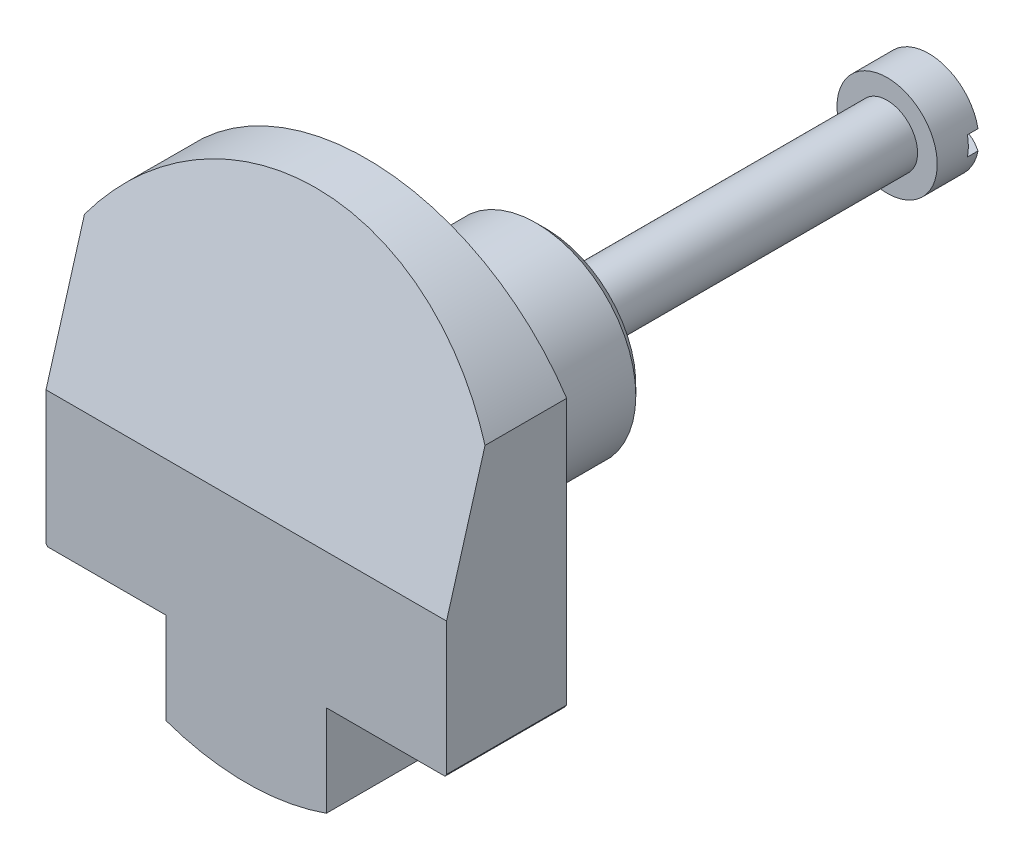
ISO-10303-21;
HEADER;
FILE_DESCRIPTION(('STEP AP214'),'2;1');
FILE_NAME('part.step','',(''),(''),'','','');
FILE_SCHEMA(('AUTOMOTIVE_DESIGN { 1 0 10303 214 1 1 1 1 }'));
ENDSEC;
DATA;
#1=APPLICATION_CONTEXT('core data for automotive mechanical design processes');
#2=APPLICATION_PROTOCOL_DEFINITION('international standard','automotive_design',2000,#1);
#3=PRODUCT_CONTEXT('',#1,'mechanical');
#4=PRODUCT('Part','Part','',(#3));
#5=PRODUCT_RELATED_PRODUCT_CATEGORY('part','',(#4));
#6=PRODUCT_DEFINITION_FORMATION('','',#4);
#7=PRODUCT_DEFINITION_CONTEXT('part definition',#1,'design');
#8=PRODUCT_DEFINITION('design','',#6,#7);
#9=PRODUCT_DEFINITION_SHAPE('','',#8);
#10=(LENGTH_UNIT() NAMED_UNIT(*) SI_UNIT(.MILLI.,.METRE.));
#11=(NAMED_UNIT(*) PLANE_ANGLE_UNIT() SI_UNIT($,.RADIAN.));
#12=(NAMED_UNIT(*) SI_UNIT($,.STERADIAN.) SOLID_ANGLE_UNIT());
#13=UNCERTAINTY_MEASURE_WITH_UNIT(LENGTH_MEASURE(1.E-05),#10,'distance_accuracy_value','');
#14=(GEOMETRIC_REPRESENTATION_CONTEXT(3) GLOBAL_UNCERTAINTY_ASSIGNED_CONTEXT((#13)) GLOBAL_UNIT_ASSIGNED_CONTEXT((#10,
#11,#12)) REPRESENTATION_CONTEXT('',''));
#15=CARTESIAN_POINT('',(0.,0.,0.));
#16=DIRECTION('',(0.,0.,1.));
#17=DIRECTION('',(1.,0.,0.));
#18=AXIS2_PLACEMENT_3D('',#15,#16,#17);
#19=CARTESIAN_POINT('',(0.,0.,-38.9909685));
#20=DIRECTION('',(0.,0.,-1.));
#21=DIRECTION('',(0.,1.,0.));
#22=AXIS2_PLACEMENT_3D('',#19,#20,#21);
#23=SPHERICAL_SURFACE('',#22,6.85603150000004);
#24=CARTESIAN_POINT('',(0.,0.,-44.577));
#25=DIRECTION('',(0.,0.,-1.));
#26=DIRECTION('',(-1.,0.,0.));
#27=AXIS2_PLACEMENT_3D('',#24,#25,#26);
#28=CIRCLE('',#27,3.9751);
#29=CARTESIAN_POINT('',(-3.90138129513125,0.762,-44.577));
#30=VERTEX_POINT('',#29);
#31=CARTESIAN_POINT('',(3.90138129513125,0.762,-44.577));
#32=VERTEX_POINT('',#31);
#33=EDGE_CURVE('E147',#30,#32,#28,.T.);
#34=ORIENTED_EDGE('',*,*,#33,.T.);
#35=CARTESIAN_POINT('',(0.,0.762,-38.9909685));
#36=DIRECTION('',(0.,-1.,0.));
#37=DIRECTION('',(1.,0.,0.));
#38=AXIS2_PLACEMENT_3D('',#35,#36,#37);
#39=CIRCLE('',#38,6.81355442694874);
#40=EDGE_CURVE('E136',#32,#30,#39,.F.);
#41=ORIENTED_EDGE('',*,*,#40,.T.);
#42=EDGE_LOOP('',(#34,#41));
#43=FACE_BOUND('',#42,.T.);
#44=ADVANCED_FACE('F14',(#43),#23,.T.);
#45=CARTESIAN_POINT('',(-3.9751,0.762,-43.7388));
#46=DIRECTION('',(0.,-1.,0.));
#47=DIRECTION('',(1.,0.,0.));
#48=AXIS2_PLACEMENT_3D('',#45,#46,#47);
#49=PLANE('',#48);
#50=DIRECTION('',(0.,0.,-1.));
#51=VECTOR('',#50,1.);
#52=CARTESIAN_POINT('',(-3.90138129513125,0.762,-71.247));
#53=LINE('',#52,#51);
#54=CARTESIAN_POINT('',(-3.90138129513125,0.762,-43.7388));
#55=VERTEX_POINT('',#54);
#56=EDGE_CURVE('E132',#55,#30,#53,.T.);
#57=ORIENTED_EDGE('',*,*,#56,.T.);
#58=ORIENTED_EDGE('',*,*,#40,.F.);
#59=DIRECTION('',(0.,0.,-1.));
#60=VECTOR('',#59,1.);
#61=CARTESIAN_POINT('',(3.90138129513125,0.762,-71.247));
#62=LINE('',#61,#60);
#63=CARTESIAN_POINT('',(3.90138129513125,0.762,-43.7388));
#64=VERTEX_POINT('',#63);
#65=EDGE_CURVE('E151',#32,#64,#62,.F.);
#66=ORIENTED_EDGE('',*,*,#65,.T.);
#67=DIRECTION('',(-1.,0.,0.));
#68=VECTOR('',#67,1.);
#69=CARTESIAN_POINT('',(-3.9751,0.762,-43.7388));
#70=LINE('',#69,#68);
#71=EDGE_CURVE('E139',#64,#55,#70,.T.);
#72=ORIENTED_EDGE('',*,*,#71,.T.);
#73=EDGE_LOOP('',(#57,#58,#66,#72));
#74=FACE_BOUND('',#73,.T.);
#75=ADVANCED_FACE('F134',(#74),#49,.T.);
#76=CARTESIAN_POINT('',(3.9751,-0.762,-43.7388));
#77=DIRECTION('',(0.,0.,1.));
#78=DIRECTION('',(1.,0.,0.));
#79=AXIS2_PLACEMENT_3D('',#76,#77,#78);
#80=PLANE('',#79);
#81=ORIENTED_EDGE('',*,*,#71,.F.);
#82=CARTESIAN_POINT('',(0.,0.,-43.7388));
#83=DIRECTION('',(0.,0.,1.));
#84=DIRECTION('',(1.,0.,0.));
#85=AXIS2_PLACEMENT_3D('',#82,#83,#84);
#86=CIRCLE('',#85,3.9751);
#87=CARTESIAN_POINT('',(3.90138129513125,-0.762,-43.7388));
#88=VERTEX_POINT('',#87);
#89=EDGE_CURVE('E152',#88,#64,#86,.T.);
#90=ORIENTED_EDGE('',*,*,#89,.F.);
#91=DIRECTION('',(1.,0.,0.));
#92=VECTOR('',#91,1.);
#93=CARTESIAN_POINT('',(3.9751,-0.762,-43.7388));
#94=LINE('',#93,#92);
#95=CARTESIAN_POINT('',(-3.90138129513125,-0.762,-43.7388));
#96=VERTEX_POINT('',#95);
#97=EDGE_CURVE('E244',#96,#88,#94,.T.);
#98=ORIENTED_EDGE('',*,*,#97,.F.);
#99=EDGE_CURVE('E143',#55,#96,#86,.T.);
#100=ORIENTED_EDGE('',*,*,#99,.F.);
#101=EDGE_LOOP('',(#81,#90,#98,#100));
#102=FACE_BOUND('',#101,.T.);
#103=ADVANCED_FACE('F282',(#102),#80,.F.);
#104=CARTESIAN_POINT('',(3.90138129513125,-0.762,-44.577));
#105=VERTEX_POINT('',#104);
#106=CARTESIAN_POINT('',(-3.90138129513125,-0.762,-44.577));
#107=VERTEX_POINT('',#106);
#108=EDGE_CURVE('E153',#105,#107,#28,.T.);
#109=ORIENTED_EDGE('',*,*,#108,.T.);
#110=CARTESIAN_POINT('',(0.,-0.762,-38.9909685));
#111=DIRECTION('',(0.,1.,0.));
#112=DIRECTION('',(-1.,0.,0.));
#113=AXIS2_PLACEMENT_3D('',#110,#111,#112);
#114=CIRCLE('',#113,6.81355442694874);
#115=EDGE_CURVE('E148',#107,#105,#114,.F.);
#116=ORIENTED_EDGE('',*,*,#115,.T.);
#117=EDGE_LOOP('',(#109,#116));
#118=FACE_BOUND('',#117,.T.);
#119=ADVANCED_FACE('F277',(#118),#23,.T.);
#120=CARTESIAN_POINT('',(3.9751,-0.762,-43.7388));
#121=DIRECTION('',(0.,1.,0.));
#122=DIRECTION('',(-1.,0.,0.));
#123=AXIS2_PLACEMENT_3D('',#120,#121,#122);
#124=PLANE('',#123);
#125=DIRECTION('',(0.,0.,-1.));
#126=VECTOR('',#125,1.);
#127=CARTESIAN_POINT('',(3.90138129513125,-0.762,-71.247));
#128=LINE('',#127,#126);
#129=EDGE_CURVE('E33',#88,#105,#128,.T.);
#130=ORIENTED_EDGE('',*,*,#129,.T.);
#131=ORIENTED_EDGE('',*,*,#115,.F.);
#132=DIRECTION('',(0.,0.,-1.));
#133=VECTOR('',#132,1.);
#134=CARTESIAN_POINT('',(-3.90138129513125,-0.762,-71.247));
#135=LINE('',#134,#133);
#136=EDGE_CURVE('E115',#107,#96,#135,.F.);
#137=ORIENTED_EDGE('',*,*,#136,.T.);
#138=ORIENTED_EDGE('',*,*,#97,.T.);
#139=EDGE_LOOP('',(#130,#131,#137,#138));
#140=FACE_BOUND('',#139,.T.);
#141=ADVANCED_FACE('F272',(#140),#124,.T.);
#142=CARTESIAN_POINT('',(0.,0.,-71.247));
#143=DIRECTION('',(0.,0.,-1.));
#144=DIRECTION('',(-1.,0.,0.));
#145=AXIS2_PLACEMENT_3D('',#142,#143,#144);
#146=CYLINDRICAL_SURFACE('',#145,3.9751);
#147=CARTESIAN_POINT('',(0.,0.,-41.275));
#148=DIRECTION('',(0.,0.,-1.));
#149=DIRECTION('',(-1.,0.,0.));
#150=AXIS2_PLACEMENT_3D('',#147,#148,#149);
#151=CIRCLE('',#150,3.9751);
#152=CARTESIAN_POINT('',(-3.9751,0.,-41.275));
#153=VERTEX_POINT('',#152);
#154=EDGE_CURVE('E157',#153,#153,#151,.T.);
#155=ORIENTED_EDGE('',*,*,#154,.T.);
#156=EDGE_LOOP('',(#155));
#157=FACE_BOUND('',#156,.T.);
#158=ORIENTED_EDGE('',*,*,#136,.F.);
#159=ORIENTED_EDGE('',*,*,#108,.F.);
#160=ORIENTED_EDGE('',*,*,#129,.F.);
#161=ORIENTED_EDGE('',*,*,#89,.T.);
#162=ORIENTED_EDGE('',*,*,#65,.F.);
#163=ORIENTED_EDGE('',*,*,#33,.F.);
#164=ORIENTED_EDGE('',*,*,#56,.F.);
#165=ORIENTED_EDGE('',*,*,#99,.T.);
#166=EDGE_LOOP('',(#158,#159,#160,#161,#162,#163,#164,#165));
#167=FACE_BOUND('',#166,.T.);
#168=ADVANCED_FACE('F150',(#157,#167),#146,.T.);
#169=CARTESIAN_POINT('',(0.,2.413,-41.275));
#170=DIRECTION('',(0.,0.,-1.));
#171=DIRECTION('',(-1.,0.,0.));
#172=AXIS2_PLACEMENT_3D('',#169,#170,#171);
#173=PLANE('',#172);
#174=ORIENTED_EDGE('',*,*,#154,.F.);
#175=EDGE_LOOP('',(#174));
#176=FACE_BOUND('',#175,.T.);
#177=CARTESIAN_POINT('',(0.,0.,-41.275));
#178=DIRECTION('',(0.,0.,-1.));
#179=DIRECTION('',(-1.,0.,0.));
#180=AXIS2_PLACEMENT_3D('',#177,#178,#179);
#181=CIRCLE('',#180,2.413);
#182=CARTESIAN_POINT('',(-2.413,0.,-41.275));
#183=VERTEX_POINT('',#182);
#184=EDGE_CURVE('E251',#183,#183,#181,.T.);
#185=ORIENTED_EDGE('',*,*,#184,.T.);
#186=EDGE_LOOP('',(#185));
#187=FACE_BOUND('',#186,.T.);
#188=ADVANCED_FACE('F259',(#176,#187),#173,.F.);
#189=CARTESIAN_POINT('',(0.,0.,-71.247));
#190=DIRECTION('',(0.,0.,-1.));
#191=DIRECTION('',(-1.,0.,0.));
#192=AXIS2_PLACEMENT_3D('',#189,#190,#191);
#193=CYLINDRICAL_SURFACE('',#192,2.413);
#194=CARTESIAN_POINT('',(0.,0.,-14.224));
#195=DIRECTION('',(0.,0.,-1.));
#196=DIRECTION('',(-1.,0.,0.));
#197=AXIS2_PLACEMENT_3D('',#194,#195,#196);
#198=CIRCLE('',#197,2.413);
#199=CARTESIAN_POINT('',(-2.413,0.,-14.224));
#200=VERTEX_POINT('',#199);
#201=EDGE_CURVE('E9',#200,#200,#198,.F.);
#202=ORIENTED_EDGE('',*,*,#201,.F.);
#203=EDGE_LOOP('',(#202));
#204=FACE_BOUND('',#203,.T.);
#205=ORIENTED_EDGE('',*,*,#184,.F.);
#206=EDGE_LOOP('',(#205));
#207=FACE_BOUND('',#206,.T.);
#208=ADVANCED_FACE('F261',(#204,#207),#193,.T.);
#209=CARTESIAN_POINT('',(0.,0.,-14.224));
#210=DIRECTION('',(0.,0.,-1.));
#211=DIRECTION('',(-1.,0.,0.));
#212=AXIS2_PLACEMENT_3D('',#209,#210,#211);
#213=PLANE('',#212);
#214=CARTESIAN_POINT('',(0.,0.,-14.224));
#215=DIRECTION('',(0.,0.,-1.));
#216=DIRECTION('',(-1.,0.,0.));
#217=AXIS2_PLACEMENT_3D('',#214,#215,#216);
#218=CIRCLE('',#217,7.13105);
#219=CARTESIAN_POINT('',(-7.13105,0.,-14.224));
#220=VERTEX_POINT('',#219);
#221=EDGE_CURVE('E164',#220,#220,#218,.T.);
#222=ORIENTED_EDGE('',*,*,#221,.T.);
#223=EDGE_LOOP('',(#222));
#224=FACE_BOUND('',#223,.T.);
#225=ORIENTED_EDGE('',*,*,#201,.T.);
#226=EDGE_LOOP('',(#225));
#227=FACE_BOUND('',#226,.T.);
#228=ADVANCED_FACE('F269',(#224,#227),#213,.T.);
#229=CARTESIAN_POINT('',(0.,0.,-14.224));
#230=DIRECTION('',(0.,0.,1.));
#231=DIRECTION('',(1.,0.,0.));
#232=AXIS2_PLACEMENT_3D('',#229,#230,#231);
#233=CONICAL_SURFACE('',#232,7.13105,0.785398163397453);
#234=CARTESIAN_POINT('',(0.,0.,-13.462));
#235=DIRECTION('',(0.,0.,-1.));
#236=DIRECTION('',(-1.,0.,0.));
#237=AXIS2_PLACEMENT_3D('',#234,#235,#236);
#238=CIRCLE('',#237,7.89305);
#239=CARTESIAN_POINT('',(-7.89305,0.,-13.462));
#240=VERTEX_POINT('',#239);
#241=EDGE_CURVE('E24',#240,#240,#238,.F.);
#242=ORIENTED_EDGE('',*,*,#241,.F.);
#243=EDGE_LOOP('',(#242));
#244=FACE_BOUND('',#243,.T.);
#245=ORIENTED_EDGE('',*,*,#221,.F.);
#246=EDGE_LOOP('',(#245));
#247=FACE_BOUND('',#246,.T.);
#248=ADVANCED_FACE('F302',(#244,#247),#233,.T.);
#249=CARTESIAN_POINT('',(0.,0.,-14.224));
#250=DIRECTION('',(0.,0.,1.));
#251=DIRECTION('',(1.,0.,0.));
#252=AXIS2_PLACEMENT_3D('',#249,#250,#251);
#253=CYLINDRICAL_SURFACE('',#252,7.89305);
#254=ORIENTED_EDGE('',*,*,#241,.T.);
#255=EDGE_LOOP('',(#254));
#256=FACE_BOUND('',#255,.T.);
#257=CARTESIAN_POINT('',(0.,0.,0.));
#258=DIRECTION('',(0.,0.,-1.));
#259=DIRECTION('',(0.,-1.,0.));
#260=AXIS2_PLACEMENT_3D('',#257,#258,#259);
#261=CIRCLE('',#260,7.89305);
#262=CARTESIAN_POINT('',(0.,-7.89305,0.));
#263=VERTEX_POINT('',#262);
#264=EDGE_CURVE('E168',#263,#263,#261,.F.);
#265=ORIENTED_EDGE('',*,*,#264,.F.);
#266=EDGE_LOOP('',(#265));
#267=FACE_BOUND('',#266,.T.);
#268=ADVANCED_FACE('F298',(#256,#267),#253,.T.);
#269=CARTESIAN_POINT('',(21.32965,0.,9.525));
#270=DIRECTION('',(0.,-0.278243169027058,-0.960510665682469));
#271=DIRECTION('',(0.,-0.960510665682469,0.278243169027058));
#272=AXIS2_PLACEMENT_3D('',#269,#270,#271);
#273=PLANE('',#272);
#274=CARTESIAN_POINT('',(0.,0.,9.525));
#275=DIRECTION('',(0.,-0.278243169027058,-0.960510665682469));
#276=DIRECTION('',(0.,-0.960510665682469,0.278243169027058));
#277=AXIS2_PLACEMENT_3D('',#274,#275,#276);
#278=ELLIPSE('',#277,19.8331998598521,19.05);
#279=CARTESIAN_POINT('',(15.875,10.5302837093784,6.47456067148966));
#280=VERTEX_POINT('',#279);
#281=CARTESIAN_POINT('',(-15.875,10.5302837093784,6.47456067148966));
#282=VERTEX_POINT('',#281);
#283=EDGE_CURVE('E109',#280,#282,#278,.F.);
#284=ORIENTED_EDGE('',*,*,#283,.T.);
#285=DIRECTION('',(0.,0.960510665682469,-0.278243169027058));
#286=VECTOR('',#285,1.);
#287=CARTESIAN_POINT('',(-15.875,21.0547092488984,3.42581835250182));
#288=LINE('',#287,#286);
#289=CARTESIAN_POINT('',(-15.875,0.,9.525));
#290=VERTEX_POINT('',#289);
#291=EDGE_CURVE('E18',#290,#282,#288,.T.);
#292=ORIENTED_EDGE('',*,*,#291,.F.);
#293=DIRECTION('',(-1.,0.,0.));
#294=VECTOR('',#293,1.);
#295=CARTESIAN_POINT('',(21.32965,0.,9.525));
#296=LINE('',#295,#294);
#297=CARTESIAN_POINT('',(15.875,0.,9.525));
#298=VERTEX_POINT('',#297);
#299=EDGE_CURVE('E165',#298,#290,#296,.T.);
#300=ORIENTED_EDGE('',*,*,#299,.F.);
#301=DIRECTION('',(0.,-0.960510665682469,0.278243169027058));
#302=VECTOR('',#301,1.);
#303=CARTESIAN_POINT('',(15.875,21.0547092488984,3.42581835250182));
#304=LINE('',#303,#302);
#305=EDGE_CURVE('E170',#280,#298,#304,.T.);
#306=ORIENTED_EDGE('',*,*,#305,.F.);
#307=EDGE_LOOP('',(#284,#292,#300,#306));
#308=FACE_BOUND('',#307,.T.);
#309=ADVANCED_FACE('F301',(#308),#273,.F.);
#310=CARTESIAN_POINT('',(0.,19.05,9.525));
#311=DIRECTION('',(0.,0.,1.));
#312=DIRECTION('',(0.,1.,0.));
#313=AXIS2_PLACEMENT_3D('',#310,#311,#312);
#314=PLANE('',#313);
#315=ORIENTED_EDGE('',*,*,#299,.T.);
#316=DIRECTION('',(0.,1.,0.));
#317=VECTOR('',#316,1.);
#318=CARTESIAN_POINT('',(-15.875,19.05,9.525));
#319=LINE('',#318,#317);
#320=CARTESIAN_POINT('',(-15.875,-10.5302837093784,9.525));
#321=VERTEX_POINT('',#320);
#322=EDGE_CURVE('E213',#321,#290,#319,.T.);
#323=ORIENTED_EDGE('',*,*,#322,.F.);
#324=CARTESIAN_POINT('',(0.,0.,9.525));
#325=DIRECTION('',(0.,0.,1.));
#326=DIRECTION('',(0.,1.,0.));
#327=AXIS2_PLACEMENT_3D('',#324,#325,#326);
#328=CIRCLE('',#327,19.05);
#329=CARTESIAN_POINT('',(-15.7504882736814,-10.715625,9.525));
#330=VERTEX_POINT('',#329);
#331=EDGE_CURVE('E220',#321,#330,#328,.T.);
#332=ORIENTED_EDGE('',*,*,#331,.T.);
#333=DIRECTION('',(-1.,0.,0.));
#334=VECTOR('',#333,1.);
#335=CARTESIAN_POINT('',(0.,-10.715625,9.525));
#336=LINE('',#335,#334);
#337=CARTESIAN_POINT('',(-6.35,-10.715625,9.525));
#338=VERTEX_POINT('',#337);
#339=EDGE_CURVE('E103',#338,#330,#336,.T.);
#340=ORIENTED_EDGE('',*,*,#339,.F.);
#341=DIRECTION('',(0.,1.,0.));
#342=VECTOR('',#341,1.);
#343=CARTESIAN_POINT('',(-6.35,19.05,9.525));
#344=LINE('',#343,#342);
#345=CARTESIAN_POINT('',(-6.35,-17.9605122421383,9.525));
#346=VERTEX_POINT('',#345);
#347=EDGE_CURVE('E202',#346,#338,#344,.T.);
#348=ORIENTED_EDGE('',*,*,#347,.F.);
#349=CARTESIAN_POINT('',(6.35,-17.9605122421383,9.525));
#350=VERTEX_POINT('',#349);
#351=EDGE_CURVE('E219',#346,#350,#328,.T.);
#352=ORIENTED_EDGE('',*,*,#351,.T.);
#353=DIRECTION('',(0.,-1.,0.));
#354=VECTOR('',#353,1.);
#355=CARTESIAN_POINT('',(6.35,19.05,9.525));
#356=LINE('',#355,#354);
#357=CARTESIAN_POINT('',(6.35,-10.715625,9.525));
#358=VERTEX_POINT('',#357);
#359=EDGE_CURVE('E196',#358,#350,#356,.T.);
#360=ORIENTED_EDGE('',*,*,#359,.F.);
#361=DIRECTION('',(-1.,0.,0.));
#362=VECTOR('',#361,1.);
#363=CARTESIAN_POINT('',(0.,-10.715625,9.525));
#364=LINE('',#363,#362);
#365=CARTESIAN_POINT('',(15.7504882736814,-10.715625,9.525));
#366=VERTEX_POINT('',#365);
#367=EDGE_CURVE('E190',#366,#358,#364,.T.);
#368=ORIENTED_EDGE('',*,*,#367,.F.);
#369=CARTESIAN_POINT('',(15.875,-10.5302837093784,9.525));
#370=VERTEX_POINT('',#369);
#371=EDGE_CURVE('E216',#366,#370,#328,.T.);
#372=ORIENTED_EDGE('',*,*,#371,.T.);
#373=DIRECTION('',(0.,-1.,0.));
#374=VECTOR('',#373,1.);
#375=CARTESIAN_POINT('',(15.875,19.05,9.525));
#376=LINE('',#375,#374);
#377=EDGE_CURVE('E185',#298,#370,#376,.T.);
#378=ORIENTED_EDGE('',*,*,#377,.F.);
#379=EDGE_LOOP('',(#315,#323,#332,#340,#348,#352,#360,#368,#372,#378));
#380=FACE_BOUND('',#379,.T.);
#381=ADVANCED_FACE('F357',(#380),#314,.T.);
#382=CARTESIAN_POINT('',(0.,0.,10.4507545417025));
#383=DIRECTION('',(0.,0.,1.));
#384=DIRECTION('',(0.,1.,0.));
#385=AXIS2_PLACEMENT_3D('',#382,#383,#384);
#386=CYLINDRICAL_SURFACE('',#385,19.05);
#387=DIRECTION('',(0.,0.,1.));
#388=VECTOR('',#387,1.);
#389=CARTESIAN_POINT('',(-15.875,-10.5302837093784,10.4507545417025));
#390=LINE('',#389,#388);
#391=CARTESIAN_POINT('',(-15.875,-10.5302837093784,0.));
#392=VERTEX_POINT('',#391);
#393=EDGE_CURVE('E208',#392,#321,#390,.T.);
#394=ORIENTED_EDGE('',*,*,#393,.F.);
#395=CARTESIAN_POINT('',(0.,0.,0.));
#396=DIRECTION('',(0.,0.,1.));
#397=DIRECTION('',(0.,1.,0.));
#398=AXIS2_PLACEMENT_3D('',#395,#396,#397);
#399=CIRCLE('',#398,19.05);
#400=CARTESIAN_POINT('',(-15.7504882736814,-10.715625,0.));
#401=VERTEX_POINT('',#400);
#402=EDGE_CURVE('E225',#392,#401,#399,.T.);
#403=ORIENTED_EDGE('',*,*,#402,.T.);
#404=DIRECTION('',(0.,0.,1.));
#405=VECTOR('',#404,1.);
#406=CARTESIAN_POINT('',(-15.7504882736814,-10.715625,10.4507545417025));
#407=LINE('',#406,#405);
#408=EDGE_CURVE('E204',#330,#401,#407,.F.);
#409=ORIENTED_EDGE('',*,*,#408,.F.);
#410=ORIENTED_EDGE('',*,*,#331,.F.);
#411=EDGE_LOOP('',(#394,#403,#409,#410));
#412=FACE_BOUND('',#411,.T.);
#413=ADVANCED_FACE('F348',(#412),#386,.T.);
#414=CARTESIAN_POINT('',(-15.875,-10.715625,-6.35));
#415=DIRECTION('',(0.,1.,0.));
#416=DIRECTION('',(-1.,0.,0.));
#417=AXIS2_PLACEMENT_3D('',#414,#415,#416);
#418=PLANE('',#417);
#419=DIRECTION('',(0.,0.,1.));
#420=VECTOR('',#419,1.);
#421=CARTESIAN_POINT('',(-6.35,-10.715625,-6.35));
#422=LINE('',#421,#420);
#423=CARTESIAN_POINT('',(-6.35,-10.715625,0.));
#424=VERTEX_POINT('',#423);
#425=EDGE_CURVE('E176',#424,#338,#422,.T.);
#426=ORIENTED_EDGE('',*,*,#425,.T.);
#427=ORIENTED_EDGE('',*,*,#339,.T.);
#428=ORIENTED_EDGE('',*,*,#408,.T.);
#429=DIRECTION('',(1.,0.,0.));
#430=VECTOR('',#429,1.);
#431=CARTESIAN_POINT('',(0.,-10.715625,0.));
#432=LINE('',#431,#430);
#433=EDGE_CURVE('E238',#401,#424,#432,.T.);
#434=ORIENTED_EDGE('',*,*,#433,.T.);
#435=EDGE_LOOP('',(#426,#427,#428,#434));
#436=FACE_BOUND('',#435,.T.);
#437=ADVANCED_FACE('F351',(#436),#418,.F.);
#438=CARTESIAN_POINT('',(-6.35,-10.715625,-6.35));
#439=DIRECTION('',(1.,0.,0.));
#440=DIRECTION('',(0.,1.,0.));
#441=AXIS2_PLACEMENT_3D('',#438,#439,#440);
#442=PLANE('',#441);
#443=DIRECTION('',(0.,0.,1.));
#444=VECTOR('',#443,1.);
#445=CARTESIAN_POINT('',(-6.35,-17.9605122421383,10.4507545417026));
#446=LINE('',#445,#444);
#447=CARTESIAN_POINT('',(-6.35,-17.9605122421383,0.));
#448=VERTEX_POINT('',#447);
#449=EDGE_CURVE('E199',#448,#346,#446,.T.);
#450=ORIENTED_EDGE('',*,*,#449,.T.);
#451=ORIENTED_EDGE('',*,*,#347,.T.);
#452=ORIENTED_EDGE('',*,*,#425,.F.);
#453=DIRECTION('',(0.,-1.,0.));
#454=VECTOR('',#453,1.);
#455=CARTESIAN_POINT('',(-6.35,2.413,0.));
#456=LINE('',#455,#454);
#457=EDGE_CURVE('E235',#424,#448,#456,.T.);
#458=ORIENTED_EDGE('',*,*,#457,.T.);
#459=EDGE_LOOP('',(#450,#451,#452,#458));
#460=FACE_BOUND('',#459,.T.);
#461=ADVANCED_FACE('F354',(#460),#442,.F.);
#462=ORIENTED_EDGE('',*,*,#449,.F.);
#463=CARTESIAN_POINT('',(6.35,-17.9605122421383,0.));
#464=VERTEX_POINT('',#463);
#465=EDGE_CURVE('E343',#448,#464,#399,.T.);
#466=ORIENTED_EDGE('',*,*,#465,.T.);
#467=DIRECTION('',(0.,0.,1.));
#468=VECTOR('',#467,1.);
#469=CARTESIAN_POINT('',(6.35,-17.9605122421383,10.4507545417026));
#470=LINE('',#469,#468);
#471=EDGE_CURVE('E193',#350,#464,#470,.F.);
#472=ORIENTED_EDGE('',*,*,#471,.F.);
#473=ORIENTED_EDGE('',*,*,#351,.F.);
#474=EDGE_LOOP('',(#462,#466,#472,#473));
#475=FACE_BOUND('',#474,.T.);
#476=ADVANCED_FACE('F358',(#475),#386,.T.);
#477=CARTESIAN_POINT('',(6.35,-10.715625,-6.35));
#478=DIRECTION('',(-1.,0.,0.));
#479=DIRECTION('',(0.,-1.,0.));
#480=AXIS2_PLACEMENT_3D('',#477,#478,#479);
#481=PLANE('',#480);
#482=DIRECTION('',(0.,0.,1.));
#483=VECTOR('',#482,1.);
#484=CARTESIAN_POINT('',(6.35,-10.715625,-6.35));
#485=LINE('',#484,#483);
#486=CARTESIAN_POINT('',(6.35,-10.715625,0.));
#487=VERTEX_POINT('',#486);
#488=EDGE_CURVE('E173',#487,#358,#485,.T.);
#489=ORIENTED_EDGE('',*,*,#488,.T.);
#490=ORIENTED_EDGE('',*,*,#359,.T.);
#491=ORIENTED_EDGE('',*,*,#471,.T.);
#492=DIRECTION('',(0.,1.,0.));
#493=VECTOR('',#492,1.);
#494=CARTESIAN_POINT('',(6.35,2.413,0.));
#495=LINE('',#494,#493);
#496=EDGE_CURVE('E232',#464,#487,#495,.T.);
#497=ORIENTED_EDGE('',*,*,#496,.T.);
#498=EDGE_LOOP('',(#489,#490,#491,#497));
#499=FACE_BOUND('',#498,.T.);
#500=ADVANCED_FACE('F373',(#499),#481,.F.);
#501=CARTESIAN_POINT('',(15.875,-10.715625,-6.35));
#502=DIRECTION('',(0.,1.,0.));
#503=DIRECTION('',(-1.,0.,0.));
#504=AXIS2_PLACEMENT_3D('',#501,#502,#503);
#505=PLANE('',#504);
#506=DIRECTION('',(0.,0.,1.));
#507=VECTOR('',#506,1.);
#508=CARTESIAN_POINT('',(15.7504882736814,-10.715625,10.4507545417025));
#509=LINE('',#508,#507);
#510=CARTESIAN_POINT('',(15.7504882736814,-10.715625,0.));
#511=VERTEX_POINT('',#510);
#512=EDGE_CURVE('E187',#511,#366,#509,.T.);
#513=ORIENTED_EDGE('',*,*,#512,.T.);
#514=ORIENTED_EDGE('',*,*,#367,.T.);
#515=ORIENTED_EDGE('',*,*,#488,.F.);
#516=DIRECTION('',(1.,0.,0.));
#517=VECTOR('',#516,1.);
#518=CARTESIAN_POINT('',(0.,-10.715625,0.));
#519=LINE('',#518,#517);
#520=EDGE_CURVE('E229',#487,#511,#519,.T.);
#521=ORIENTED_EDGE('',*,*,#520,.T.);
#522=EDGE_LOOP('',(#513,#514,#515,#521));
#523=FACE_BOUND('',#522,.T.);
#524=ADVANCED_FACE('F370',(#523),#505,.F.);
#525=ORIENTED_EDGE('',*,*,#512,.F.);
#526=CARTESIAN_POINT('',(15.875,-10.5302837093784,0.));
#527=VERTEX_POINT('',#526);
#528=EDGE_CURVE('E224',#511,#527,#399,.T.);
#529=ORIENTED_EDGE('',*,*,#528,.T.);
#530=DIRECTION('',(0.,0.,1.));
#531=VECTOR('',#530,1.);
#532=CARTESIAN_POINT('',(15.875,-10.5302837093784,10.4507545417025));
#533=LINE('',#532,#531);
#534=EDGE_CURVE('E182',#370,#527,#533,.F.);
#535=ORIENTED_EDGE('',*,*,#534,.F.);
#536=ORIENTED_EDGE('',*,*,#371,.F.);
#537=EDGE_LOOP('',(#525,#529,#535,#536));
#538=FACE_BOUND('',#537,.T.);
#539=ADVANCED_FACE('F341',(#538),#386,.T.);
#540=CARTESIAN_POINT('',(15.875,18.2228253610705,-6.35));
#541=DIRECTION('',(-1.,0.,0.));
#542=DIRECTION('',(0.,-1.,0.));
#543=AXIS2_PLACEMENT_3D('',#540,#541,#542);
#544=PLANE('',#543);
#545=DIRECTION('',(0.,0.,1.));
#546=VECTOR('',#545,1.);
#547=CARTESIAN_POINT('',(15.875,10.5302837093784,10.4507545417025));
#548=LINE('',#547,#546);
#549=CARTESIAN_POINT('',(15.875,10.5302837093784,0.));
#550=VERTEX_POINT('',#549);
#551=EDGE_CURVE('E179',#550,#280,#548,.T.);
#552=ORIENTED_EDGE('',*,*,#551,.T.);
#553=ORIENTED_EDGE('',*,*,#305,.T.);
#554=ORIENTED_EDGE('',*,*,#377,.T.);
#555=ORIENTED_EDGE('',*,*,#534,.T.);
#556=DIRECTION('',(0.,1.,0.));
#557=VECTOR('',#556,1.);
#558=CARTESIAN_POINT('',(15.875,2.413,0.));
#559=LINE('',#558,#557);
#560=EDGE_CURVE('E226',#527,#550,#559,.T.);
#561=ORIENTED_EDGE('',*,*,#560,.T.);
#562=EDGE_LOOP('',(#552,#553,#554,#555,#561));
#563=FACE_BOUND('',#562,.T.);
#564=ADVANCED_FACE('F336',(#563),#544,.F.);
#565=ORIENTED_EDGE('',*,*,#283,.F.);
#566=ORIENTED_EDGE('',*,*,#551,.F.);
#567=CARTESIAN_POINT('',(-15.875,10.5302837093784,0.));
#568=VERTEX_POINT('',#567);
#569=EDGE_CURVE('E221',#550,#568,#399,.T.);
#570=ORIENTED_EDGE('',*,*,#569,.T.);
#571=DIRECTION('',(0.,0.,1.));
#572=VECTOR('',#571,1.);
#573=CARTESIAN_POINT('',(-15.875,10.5302837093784,10.4507545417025));
#574=LINE('',#573,#572);
#575=EDGE_CURVE('E211',#282,#568,#574,.F.);
#576=ORIENTED_EDGE('',*,*,#575,.F.);
#577=EDGE_LOOP('',(#565,#566,#570,#576));
#578=FACE_BOUND('',#577,.T.);
#579=ADVANCED_FACE('F329',(#578),#386,.T.);
#580=CARTESIAN_POINT('',(-15.875,18.2228253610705,-6.35));
#581=DIRECTION('',(1.,0.,0.));
#582=DIRECTION('',(0.,1.,0.));
#583=AXIS2_PLACEMENT_3D('',#580,#581,#582);
#584=PLANE('',#583);
#585=ORIENTED_EDGE('',*,*,#322,.T.);
#586=ORIENTED_EDGE('',*,*,#291,.T.);
#587=ORIENTED_EDGE('',*,*,#575,.T.);
#588=DIRECTION('',(0.,-1.,0.));
#589=VECTOR('',#588,1.);
#590=CARTESIAN_POINT('',(-15.875,2.413,0.));
#591=LINE('',#590,#589);
#592=EDGE_CURVE('E240',#568,#392,#591,.T.);
#593=ORIENTED_EDGE('',*,*,#592,.T.);
#594=ORIENTED_EDGE('',*,*,#393,.T.);
#595=EDGE_LOOP('',(#585,#586,#587,#593,#594));
#596=FACE_BOUND('',#595,.T.);
#597=ADVANCED_FACE('F323',(#596),#584,.F.);
#598=CARTESIAN_POINT('',(0.,2.413,0.));
#599=DIRECTION('',(0.,0.,-1.));
#600=DIRECTION('',(0.,-1.,0.));
#601=AXIS2_PLACEMENT_3D('',#598,#599,#600);
#602=PLANE('',#601);
#603=ORIENTED_EDGE('',*,*,#592,.F.);
#604=ORIENTED_EDGE('',*,*,#569,.F.);
#605=ORIENTED_EDGE('',*,*,#560,.F.);
#606=ORIENTED_EDGE('',*,*,#528,.F.);
#607=ORIENTED_EDGE('',*,*,#520,.F.);
#608=ORIENTED_EDGE('',*,*,#496,.F.);
#609=ORIENTED_EDGE('',*,*,#465,.F.);
#610=ORIENTED_EDGE('',*,*,#457,.F.);
#611=ORIENTED_EDGE('',*,*,#433,.F.);
#612=ORIENTED_EDGE('',*,*,#402,.F.);
#613=EDGE_LOOP('',(#603,#604,#605,#606,#607,#608,#609,#610,#611,#612));
#614=FACE_BOUND('',#613,.T.);
#615=ORIENTED_EDGE('',*,*,#264,.T.);
#616=EDGE_LOOP('',(#615));
#617=FACE_BOUND('',#616,.T.);
#618=ADVANCED_FACE('F16',(#614,#617),#602,.T.);
#619=CLOSED_SHELL('',(#44,#75,#103,#119,#141,#168,#188,#208,#228,#248,#268,#309,#381,#413,#437,
#461,#476,#500,#524,#539,#564,#579,#597,#618));
#620=MANIFOLD_SOLID_BREP('B1',#619);
#621=ADVANCED_BREP_SHAPE_REPRESENTATION('',(#18,#620),#14);
#622=SHAPE_DEFINITION_REPRESENTATION(#9,#621);
ENDSEC;
END-ISO-10303-21;
